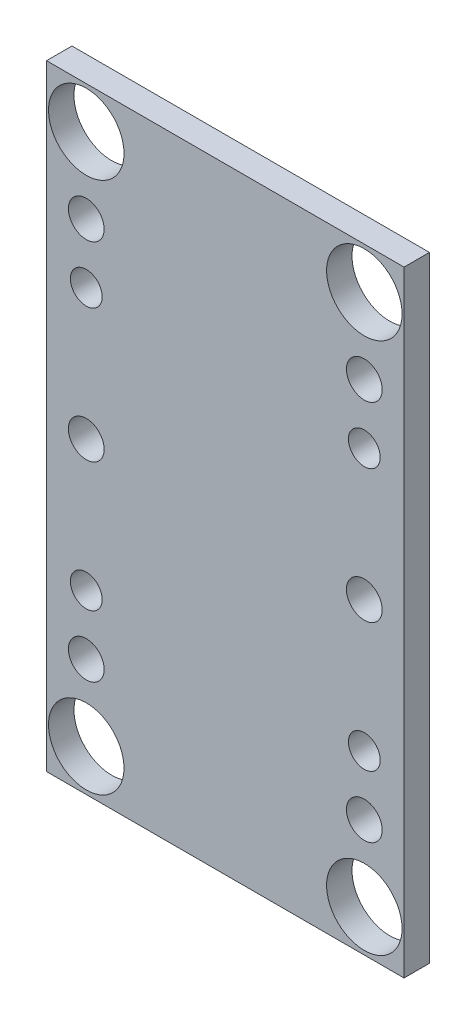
from build123d import *

# Parameters (mm, degrees)
ESQUISSE1_W             = 90
ESQUISSE1_H             = 156
ESQUISSE1_R             = 4.00375
ESQUISSE1_R_2           = 4.5
ESQUISSE1_R_3           = 9.5
EXTRUSION1_DEPTH        = 6.4
ESQUISSE2_OUTSIDE_W     = 128.042
ESQUISSE2_OUTSIDE_H     = 194.042
ESQUISSE2_OUTSIDE_W_2   = 90
ESQUISSE2_OUTSIDE_H_2   = 155
ENL_V_MAT_EXTRU_1_DEPTH = 10


with BuildPart() as part:
    # Esquisse1 → Extrusion1 (new body)
    with BuildSketch(Plane.XY):
        Rectangle(ESQUISSE1_W, ESQUISSE1_H)
        with Locations((35, 33)):
            Circle(ESQUISSE1_R, mode=Mode.SUBTRACT)
        with Locations((35, -33)):
            Circle(ESQUISSE1_R, mode=Mode.SUBTRACT)
        with Locations((35, 48)):
            Circle(ESQUISSE1_R_2, mode=Mode.SUBTRACT)
        with Locations((35, 0)):
            Circle(ESQUISSE1_R_2, mode=Mode.SUBTRACT)
        with Locations((35, -48)):
            Circle(ESQUISSE1_R_2, mode=Mode.SUBTRACT)
        with Locations((35, 67)):
            Circle(ESQUISSE1_R_3, mode=Mode.SUBTRACT)
        with Locations((35, -67)):
            Circle(ESQUISSE1_R_3, mode=Mode.SUBTRACT)
        with Locations((-35, -33)):
            Circle(ESQUISSE1_R, mode=Mode.SUBTRACT)
        with Locations((-35, 33)):
            Circle(ESQUISSE1_R, mode=Mode.SUBTRACT)
        with Locations((-35, -48)):
            Circle(ESQUISSE1_R_2, mode=Mode.SUBTRACT)
        with Locations((-35, 0)):
            Circle(ESQUISSE1_R_2, mode=Mode.SUBTRACT)
        with Locations((-35, 48)):
            Circle(ESQUISSE1_R_2, mode=Mode.SUBTRACT)
        with Locations((-35, -67)):
            Circle(ESQUISSE1_R_3, mode=Mode.SUBTRACT)
        with Locations((-35, 67)):
            Circle(ESQUISSE1_R_3, mode=Mode.SUBTRACT)
    extrude(amount=EXTRUSION1_DEPTH)

    # Esquisse2 outside → Enl_v. mat.-Extru.1 (cut)
    with BuildSketch(Plane(origin=(0, 0, 0), x_dir=(-1, 0, 0), z_dir=(0, 0, -1))):
        Rectangle(ESQUISSE2_OUTSIDE_W, ESQUISSE2_OUTSIDE_H)
        Rectangle(ESQUISSE2_OUTSIDE_W_2, ESQUISSE2_OUTSIDE_H_2, mode=Mode.SUBTRACT)
    extrude(amount=-ENL_V_MAT_EXTRU_1_DEPTH, mode=Mode.SUBTRACT)


solid = part.part
